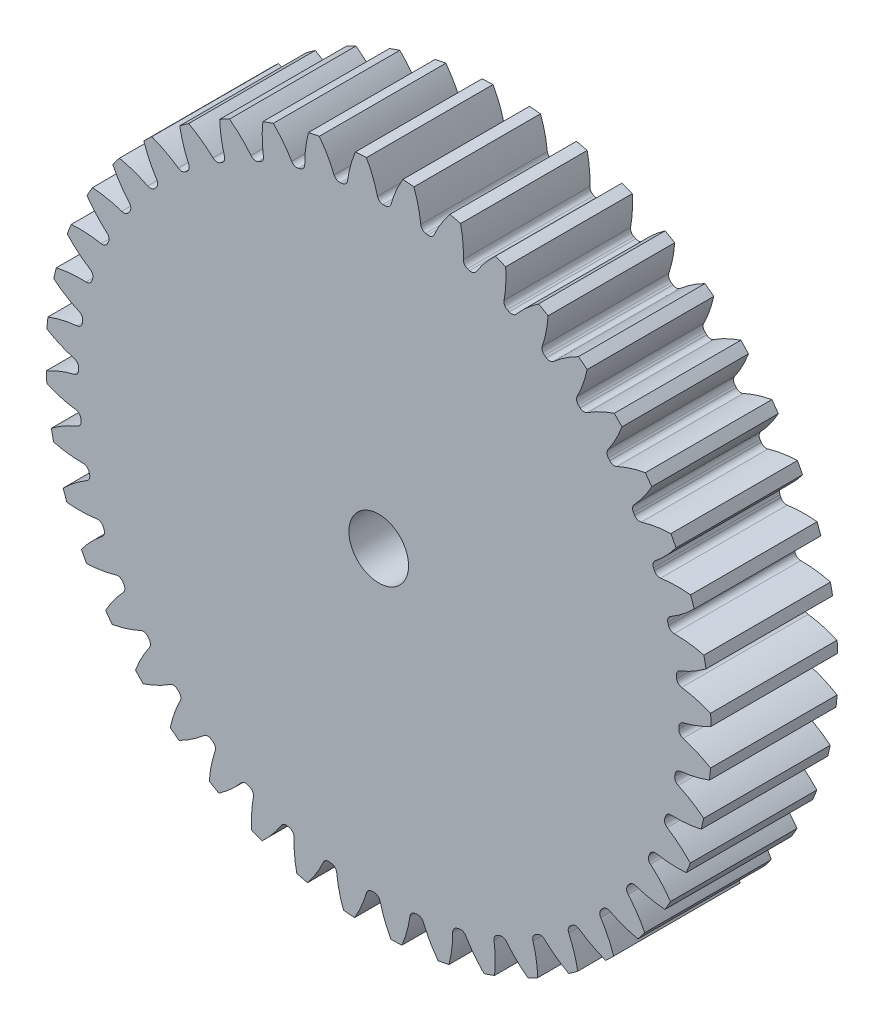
from build123d import *

# Parameters (mm, degrees)
SKETCH3_R         = 233.68
GEARBODY_DEPTH    = 88.9
TOOTHCUT_DEPTH    = 343.221996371
CIRPATTERN1_COUNT = 44
BOREDIA_R         = 20.955
BORE_DEPTH        = 12700


with BuildPart() as part:
    # Sketch3 → gearBody (new body)
    with BuildSketch(Plane.XY):
        Circle(SKETCH3_R)
    extrude(amount=GEARBODY_DEPTH)

    # Sketch2 → toothCut (cut, through all)
    with BuildSketch(Plane.XY):
        with BuildLine():
            ThreePointArc((210.771307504, -4.530820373), (210.786041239, -3.783810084), (210.798127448, -3.036752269))
            ThreePointArc((210.798127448, -3.036752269), (211.691729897, -0.528328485), (213.929349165, 0.915200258))
            ThreePointArc((213.929349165, 0.915200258), (224.057600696, 4.160482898), (233.68, 8.690689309))
            ThreePointArc((233.68, 8.690689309), (233.803882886, -4.197002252), (233.2175362, -17.071944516))
            ThreePointArc((233.2175362, -17.071944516), (223.76392692, -12.199305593), (213.758674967, -8.5926074))
            ThreePointArc((213.758674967, -8.5926074), (211.574306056, -7.06969976), (210.771307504, -4.530820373))
        make_face()
    toothcut = extrude(amount=TOOTHCUT_DEPTH, mode=Mode.SUBTRACT)

    # CirPattern1: toothCut ×44 about axis
    cirpattern1_axis = Axis((0, 0, 0), (0, 0, 1))
    for i in range(1, CIRPATTERN1_COUNT):
        add(toothcut.rotate(cirpattern1_axis, i * 360 / CIRPATTERN1_COUNT), mode=Mode.SUBTRACT)

    # boreDia → bore (cut, symmetric)
    with BuildSketch(Plane.XY):
        Circle(BOREDIA_R)
    extrude(amount=BORE_DEPTH, both=True, mode=Mode.SUBTRACT)


solid = part.part
